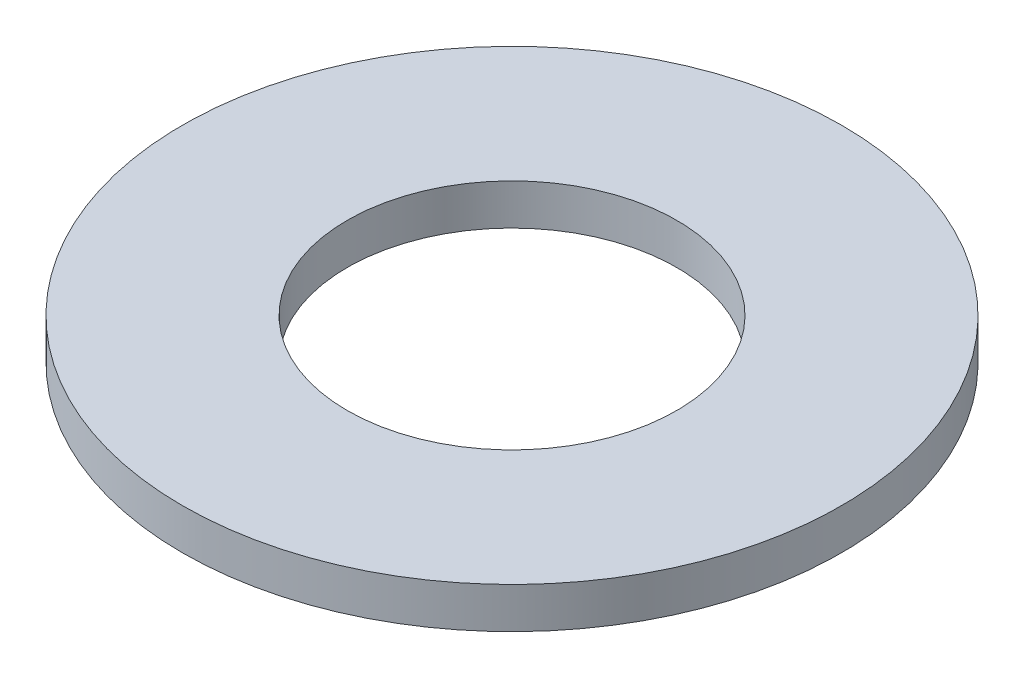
ISO-10303-21;
HEADER;
FILE_DESCRIPTION(('STEP AP214'),'2;1');
FILE_NAME('part.step','',(''),(''),'','','');
FILE_SCHEMA(('AUTOMOTIVE_DESIGN { 1 0 10303 214 1 1 1 1 }'));
ENDSEC;
DATA;
#1=APPLICATION_CONTEXT('core data for automotive mechanical design processes');
#2=APPLICATION_PROTOCOL_DEFINITION('international standard','automotive_design',2000,#1);
#3=PRODUCT_CONTEXT('',#1,'mechanical');
#4=PRODUCT('Part','Part','',(#3));
#5=PRODUCT_RELATED_PRODUCT_CATEGORY('part','',(#4));
#6=PRODUCT_DEFINITION_FORMATION('','',#4);
#7=PRODUCT_DEFINITION_CONTEXT('part definition',#1,'design');
#8=PRODUCT_DEFINITION('design','',#6,#7);
#9=PRODUCT_DEFINITION_SHAPE('','',#8);
#10=(LENGTH_UNIT() NAMED_UNIT(*) SI_UNIT(.MILLI.,.METRE.));
#11=(NAMED_UNIT(*) PLANE_ANGLE_UNIT() SI_UNIT($,.RADIAN.));
#12=(NAMED_UNIT(*) SI_UNIT($,.STERADIAN.) SOLID_ANGLE_UNIT());
#13=UNCERTAINTY_MEASURE_WITH_UNIT(LENGTH_MEASURE(1.E-05),#10,'distance_accuracy_value','');
#14=(GEOMETRIC_REPRESENTATION_CONTEXT(3) GLOBAL_UNCERTAINTY_ASSIGNED_CONTEXT((#13)) GLOBAL_UNIT_ASSIGNED_CONTEXT((#10,
#11,#12)) REPRESENTATION_CONTEXT('',''));
#15=CARTESIAN_POINT('',(0.,0.,0.));
#16=DIRECTION('',(0.,0.,1.));
#17=DIRECTION('',(1.,0.,0.));
#18=AXIS2_PLACEMENT_3D('',#15,#16,#17);
#19=CARTESIAN_POINT('',(0.,31.,0.));
#20=DIRECTION('',(0.,1.,0.));
#21=DIRECTION('',(0.,0.,1.));
#22=AXIS2_PLACEMENT_3D('',#19,#20,#21);
#23=PLANE('',#22);
#24=CARTESIAN_POINT('',(0.,31.,0.));
#25=DIRECTION('',(0.,1.,0.));
#26=DIRECTION('',(0.,0.,1.));
#27=AXIS2_PLACEMENT_3D('',#24,#25,#26);
#28=CIRCLE('',#27,250.);
#29=CARTESIAN_POINT('',(0.,31.,250.));
#30=VERTEX_POINT('',#29);
#31=EDGE_CURVE('E10',#30,#30,#28,.T.);
#32=ORIENTED_EDGE('',*,*,#31,.T.);
#33=EDGE_LOOP('',(#32));
#34=FACE_BOUND('',#33,.T.);
#35=CARTESIAN_POINT('',(0.,31.,0.));
#36=DIRECTION('',(0.,1.,0.));
#37=DIRECTION('',(0.,0.,1.));
#38=AXIS2_PLACEMENT_3D('',#35,#36,#37);
#39=CIRCLE('',#38,125.);
#40=CARTESIAN_POINT('',(0.,31.,125.));
#41=VERTEX_POINT('',#40);
#42=EDGE_CURVE('E41',#41,#41,#39,.T.);
#43=ORIENTED_EDGE('',*,*,#42,.F.);
#44=EDGE_LOOP('',(#43));
#45=FACE_BOUND('',#44,.T.);
#46=ADVANCED_FACE('F30',(#34,#45),#23,.T.);
#47=CARTESIAN_POINT('',(0.,0.,0.));
#48=DIRECTION('',(0.,1.,0.));
#49=DIRECTION('',(0.,0.,1.));
#50=AXIS2_PLACEMENT_3D('',#47,#48,#49);
#51=PLANE('',#50);
#52=CARTESIAN_POINT('',(0.,0.,0.));
#53=DIRECTION('',(0.,1.,0.));
#54=DIRECTION('',(0.,0.,1.));
#55=AXIS2_PLACEMENT_3D('',#52,#53,#54);
#56=CIRCLE('',#55,250.);
#57=CARTESIAN_POINT('',(0.,0.,250.));
#58=VERTEX_POINT('',#57);
#59=EDGE_CURVE('E34',#58,#58,#56,.T.);
#60=ORIENTED_EDGE('',*,*,#59,.F.);
#61=EDGE_LOOP('',(#60));
#62=FACE_BOUND('',#61,.T.);
#63=CARTESIAN_POINT('',(0.,0.,0.));
#64=DIRECTION('',(0.,1.,0.));
#65=DIRECTION('',(0.,0.,1.));
#66=AXIS2_PLACEMENT_3D('',#63,#64,#65);
#67=CIRCLE('',#66,125.);
#68=CARTESIAN_POINT('',(0.,0.,125.));
#69=VERTEX_POINT('',#68);
#70=EDGE_CURVE('E43',#69,#69,#67,.T.);
#71=ORIENTED_EDGE('',*,*,#70,.T.);
#72=EDGE_LOOP('',(#71));
#73=FACE_BOUND('',#72,.T.);
#74=ADVANCED_FACE('F53',(#62,#73),#51,.F.);
#75=CARTESIAN_POINT('',(0.,31.,0.));
#76=DIRECTION('',(0.,-1.,0.));
#77=DIRECTION('',(0.,0.,-1.));
#78=AXIS2_PLACEMENT_3D('',#75,#76,#77);
#79=CYLINDRICAL_SURFACE('',#78,250.);
#80=ORIENTED_EDGE('',*,*,#31,.F.);
#81=EDGE_LOOP('',(#80));
#82=FACE_BOUND('',#81,.T.);
#83=ORIENTED_EDGE('',*,*,#59,.T.);
#84=EDGE_LOOP('',(#83));
#85=FACE_BOUND('',#84,.T.);
#86=ADVANCED_FACE('F32',(#82,#85),#79,.T.);
#87=CARTESIAN_POINT('',(0.,31.,0.));
#88=DIRECTION('',(0.,-1.,0.));
#89=DIRECTION('',(0.,0.,-1.));
#90=AXIS2_PLACEMENT_3D('',#87,#88,#89);
#91=CYLINDRICAL_SURFACE('',#90,125.);
#92=ORIENTED_EDGE('',*,*,#42,.T.);
#93=EDGE_LOOP('',(#92));
#94=FACE_BOUND('',#93,.T.);
#95=ORIENTED_EDGE('',*,*,#70,.F.);
#96=EDGE_LOOP('',(#95));
#97=FACE_BOUND('',#96,.T.);
#98=ADVANCED_FACE('F49',(#94,#97),#91,.F.);
#99=CLOSED_SHELL('',(#46,#74,#86,#98));
#100=MANIFOLD_SOLID_BREP('B2',#99);
#101=ADVANCED_BREP_SHAPE_REPRESENTATION('',(#18,#100),#14);
#102=SHAPE_DEFINITION_REPRESENTATION(#9,#101);
ENDSEC;
END-ISO-10303-21;
